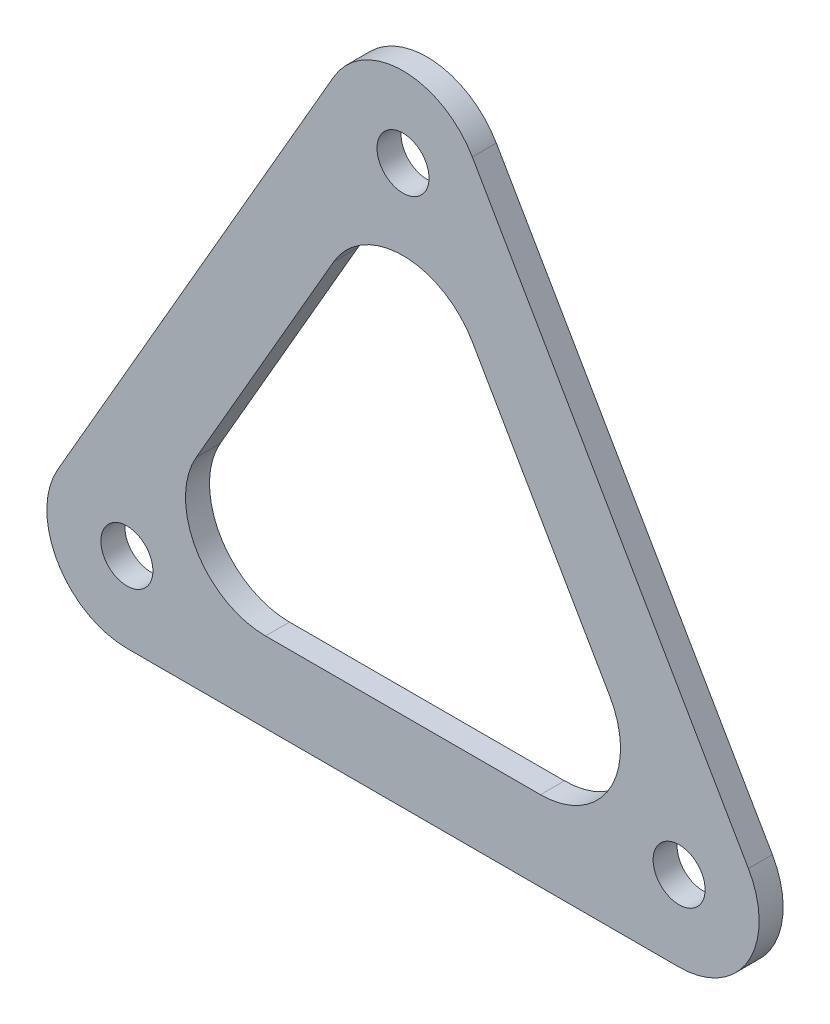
from build123d import *

# Parameters (mm, degrees)
SKETCH2_R      = 3.25
EXTRUDE1_DEPTH = 3
FILLET1_R      = 10


with BuildPart() as part:
    # Sketch2 → Extrude1 (new body)
    with BuildSketch(Plane.XY):
        Polygon((86.320508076, -10), (34.5, 79.755752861), (-17.320508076, -10), align=None)
        with Locations((34.5, 59.755752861)):
            Circle(SKETCH2_R, mode=Mode.SUBTRACT)
        with Locations((69, 0)):
            Circle(SKETCH2_R, mode=Mode.SUBTRACT)
        Circle(SKETCH2_R, mode=Mode.SUBTRACT)
        with BuildLine():
            Line((25.839745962, 44.755752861), (8.660254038, 15))
            ThreePointArc((8.660254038, 15), (8.660254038, 5), (17.320508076, 0))
            Line((17.320508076, 0), (51.679491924, 0))
            ThreePointArc((51.679491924, 0), (60.339745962, 5), (60.339745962, 15))
            Line((60.339745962, 15), (43.160254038, 44.755752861))
            ThreePointArc((43.160254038, 44.755752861), (34.5, 49.755752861), (25.839745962, 44.755752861))
        make_face(mode=Mode.SUBTRACT)
    extrude(amount=EXTRUDE1_DEPTH)

    # Fillet1
    fillet1_edges = [part.edges().sort_by_distance(p)[0] for p in [
        (-17.320508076, -10, 1.5),
        (34.5, 79.755752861, 1.5),
        (86.320508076, -10, 1.5),
    ]]
    fillet(fillet1_edges, radius=FILLET1_R)


solid = part.part
